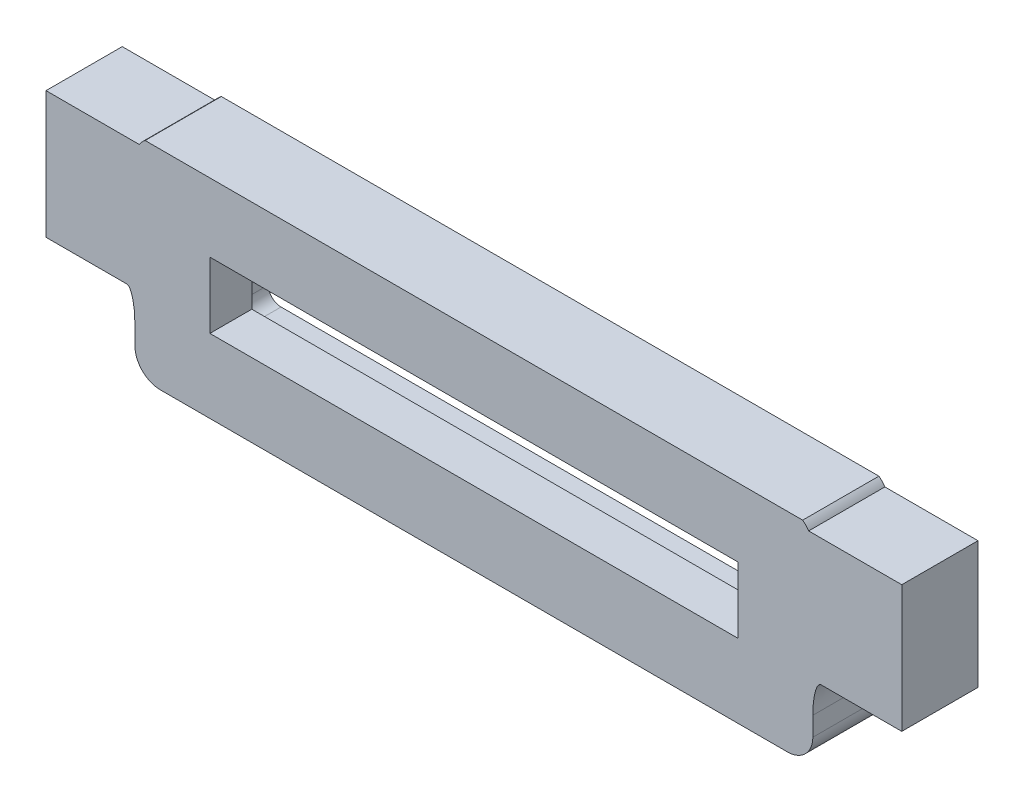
ISO-10303-21;
HEADER;
FILE_DESCRIPTION(('STEP AP214'),'2;1');
FILE_NAME('part.step','',(''),(''),'','','');
FILE_SCHEMA(('AUTOMOTIVE_DESIGN { 1 0 10303 214 1 1 1 1 }'));
ENDSEC;
DATA;
#1=APPLICATION_CONTEXT('core data for automotive mechanical design processes');
#2=APPLICATION_PROTOCOL_DEFINITION('international standard','automotive_design',2000,#1);
#3=PRODUCT_CONTEXT('',#1,'mechanical');
#4=PRODUCT('Part','Part','',(#3));
#5=PRODUCT_RELATED_PRODUCT_CATEGORY('part','',(#4));
#6=PRODUCT_DEFINITION_FORMATION('','',#4);
#7=PRODUCT_DEFINITION_CONTEXT('part definition',#1,'design');
#8=PRODUCT_DEFINITION('design','',#6,#7);
#9=PRODUCT_DEFINITION_SHAPE('','',#8);
#10=(LENGTH_UNIT() NAMED_UNIT(*) SI_UNIT(.MILLI.,.METRE.));
#11=(NAMED_UNIT(*) PLANE_ANGLE_UNIT() SI_UNIT($,.RADIAN.));
#12=(NAMED_UNIT(*) SI_UNIT($,.STERADIAN.) SOLID_ANGLE_UNIT());
#13=UNCERTAINTY_MEASURE_WITH_UNIT(LENGTH_MEASURE(1.E-05),#10,'distance_accuracy_value','');
#14=(GEOMETRIC_REPRESENTATION_CONTEXT(3) GLOBAL_UNCERTAINTY_ASSIGNED_CONTEXT((#13)) GLOBAL_UNIT_ASSIGNED_CONTEXT((#10,
#11,#12)) REPRESENTATION_CONTEXT('',''));
#15=CARTESIAN_POINT('',(0.,0.,0.));
#16=DIRECTION('',(0.,0.,1.));
#17=DIRECTION('',(1.,0.,0.));
#18=AXIS2_PLACEMENT_3D('',#15,#16,#17);
#19=CARTESIAN_POINT('',(20.78,2.6,27.));
#20=DIRECTION('',(0.,-1.,0.));
#21=DIRECTION('',(0.,0.,-1.));
#22=AXIS2_PLACEMENT_3D('',#19,#20,#21);
#23=PLANE('',#22);
#24=DIRECTION('',(1.,0.,0.));
#25=VECTOR('',#24,1.);
#26=CARTESIAN_POINT('',(20.78,2.6,22.05));
#27=LINE('',#26,#25);
#28=CARTESIAN_POINT('',(-20.78,2.6,22.05));
#29=VERTEX_POINT('',#28);
#30=CARTESIAN_POINT('',(20.78,2.6,22.05));
#31=VERTEX_POINT('',#30);
#32=EDGE_CURVE('E397',#29,#31,#27,.T.);
#33=ORIENTED_EDGE('',*,*,#32,.T.);
#34=DIRECTION('',(0.,0.,-1.));
#35=VECTOR('',#34,1.);
#36=CARTESIAN_POINT('',(20.78,2.6,27.));
#37=LINE('',#36,#35);
#38=CARTESIAN_POINT('',(20.78,2.6,25.35));
#39=VERTEX_POINT('',#38);
#40=EDGE_CURVE('E460',#39,#31,#37,.T.);
#41=ORIENTED_EDGE('',*,*,#40,.F.);
#42=DIRECTION('',(1.,0.,0.));
#43=VECTOR('',#42,1.);
#44=CARTESIAN_POINT('',(20.78,2.6,25.35));
#45=LINE('',#44,#43);
#46=CARTESIAN_POINT('',(-20.78,2.6,25.35));
#47=VERTEX_POINT('',#46);
#48=EDGE_CURVE('E286',#47,#39,#45,.T.);
#49=ORIENTED_EDGE('',*,*,#48,.F.);
#50=DIRECTION('',(0.,0.,-1.));
#51=VECTOR('',#50,1.);
#52=CARTESIAN_POINT('',(-20.78,2.6,27.));
#53=LINE('',#52,#51);
#54=EDGE_CURVE('E417',#47,#29,#53,.T.);
#55=ORIENTED_EDGE('',*,*,#54,.T.);
#56=EDGE_LOOP('',(#33,#41,#49,#55));
#57=FACE_BOUND('',#56,.T.);
#58=ADVANCED_FACE('F49',(#57),#23,.T.);
#59=CARTESIAN_POINT('',(-20.78,2.6,27.));
#60=DIRECTION('',(1.,0.,0.));
#61=DIRECTION('',(0.,0.,-1.));
#62=AXIS2_PLACEMENT_3D('',#59,#60,#61);
#63=PLANE('',#62);
#64=DIRECTION('',(0.,1.,0.));
#65=VECTOR('',#64,1.);
#66=CARTESIAN_POINT('',(-20.78,2.6,22.05));
#67=LINE('',#66,#65);
#68=CARTESIAN_POINT('',(-20.78,-2.6,22.05));
#69=VERTEX_POINT('',#68);
#70=EDGE_CURVE('E378',#69,#29,#67,.T.);
#71=ORIENTED_EDGE('',*,*,#70,.T.);
#72=ORIENTED_EDGE('',*,*,#54,.F.);
#73=DIRECTION('',(0.,1.,0.));
#74=VECTOR('',#73,1.);
#75=CARTESIAN_POINT('',(-20.78,2.6,25.35));
#76=LINE('',#75,#74);
#77=CARTESIAN_POINT('',(-20.78,-2.6,25.35));
#78=VERTEX_POINT('',#77);
#79=EDGE_CURVE('E284',#78,#47,#76,.T.);
#80=ORIENTED_EDGE('',*,*,#79,.F.);
#81=DIRECTION('',(0.,0.,-1.));
#82=VECTOR('',#81,1.);
#83=CARTESIAN_POINT('',(-20.78,-2.6,27.));
#84=LINE('',#83,#82);
#85=EDGE_CURVE('E466',#78,#69,#84,.T.);
#86=ORIENTED_EDGE('',*,*,#85,.T.);
#87=EDGE_LOOP('',(#71,#72,#80,#86));
#88=FACE_BOUND('',#87,.T.);
#89=ADVANCED_FACE('F475',(#88),#63,.T.);
#90=CARTESIAN_POINT('',(-20.78,-2.6,27.));
#91=DIRECTION('',(0.,1.,0.));
#92=DIRECTION('',(0.,0.,1.));
#93=AXIS2_PLACEMENT_3D('',#90,#91,#92);
#94=PLANE('',#93);
#95=DIRECTION('',(-1.,0.,0.));
#96=VECTOR('',#95,1.);
#97=CARTESIAN_POINT('',(-20.78,-2.6,22.05));
#98=LINE('',#97,#96);
#99=CARTESIAN_POINT('',(20.78,-2.6,22.05));
#100=VERTEX_POINT('',#99);
#101=EDGE_CURVE('E391',#100,#69,#98,.T.);
#102=ORIENTED_EDGE('',*,*,#101,.T.);
#103=ORIENTED_EDGE('',*,*,#85,.F.);
#104=DIRECTION('',(-1.,0.,0.));
#105=VECTOR('',#104,1.);
#106=CARTESIAN_POINT('',(-20.78,-2.6,25.35));
#107=LINE('',#106,#105);
#108=CARTESIAN_POINT('',(20.78,-2.6,25.35));
#109=VERTEX_POINT('',#108);
#110=EDGE_CURVE('E282',#109,#78,#107,.T.);
#111=ORIENTED_EDGE('',*,*,#110,.F.);
#112=DIRECTION('',(0.,0.,-1.));
#113=VECTOR('',#112,1.);
#114=CARTESIAN_POINT('',(20.78,-2.6,27.));
#115=LINE('',#114,#113);
#116=EDGE_CURVE('E463',#109,#100,#115,.T.);
#117=ORIENTED_EDGE('',*,*,#116,.T.);
#118=EDGE_LOOP('',(#102,#103,#111,#117));
#119=FACE_BOUND('',#118,.T.);
#120=ADVANCED_FACE('F481',(#119),#94,.T.);
#121=CARTESIAN_POINT('',(20.78,-2.6,27.));
#122=DIRECTION('',(-1.,0.,0.));
#123=DIRECTION('',(0.,0.,1.));
#124=AXIS2_PLACEMENT_3D('',#121,#122,#123);
#125=PLANE('',#124);
#126=DIRECTION('',(0.,-1.,0.));
#127=VECTOR('',#126,1.);
#128=CARTESIAN_POINT('',(20.78,-2.6,22.05));
#129=LINE('',#128,#127);
#130=EDGE_CURVE('E394',#31,#100,#129,.T.);
#131=ORIENTED_EDGE('',*,*,#130,.T.);
#132=ORIENTED_EDGE('',*,*,#116,.F.);
#133=DIRECTION('',(0.,-1.,0.));
#134=VECTOR('',#133,1.);
#135=CARTESIAN_POINT('',(20.78,-2.6,25.35));
#136=LINE('',#135,#134);
#137=EDGE_CURVE('E280',#39,#109,#136,.T.);
#138=ORIENTED_EDGE('',*,*,#137,.F.);
#139=ORIENTED_EDGE('',*,*,#40,.T.);
#140=EDGE_LOOP('',(#131,#132,#138,#139));
#141=FACE_BOUND('',#140,.T.);
#142=ADVANCED_FACE('F486',(#141),#125,.T.);
#143=CARTESIAN_POINT('',(-26.68,8.4,27.));
#144=DIRECTION('',(1.,0.,0.));
#145=DIRECTION('',(0.,0.,-1.));
#146=AXIS2_PLACEMENT_3D('',#143,#144,#145);
#147=PLANE('',#146);
#148=DIRECTION('',(0.,-1.,0.));
#149=VECTOR('',#148,1.);
#150=CARTESIAN_POINT('',(-26.68,-8.4,25.35));
#151=LINE('',#150,#149);
#152=CARTESIAN_POINT('',(-26.68,-4.89999999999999,25.35));
#153=VERTEX_POINT('',#152);
#154=CARTESIAN_POINT('',(-26.68,-6.4,25.35));
#155=VERTEX_POINT('',#154);
#156=EDGE_CURVE('E262',#153,#155,#151,.T.);
#157=ORIENTED_EDGE('',*,*,#156,.F.);
#158=CARTESIAN_POINT('',(-26.68,-4.89999999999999,19.05));
#159=CARTESIAN_POINT('',(-26.68,-4.89999999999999,21.25));
#160=CARTESIAN_POINT('',(-26.68,-4.89999999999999,23.45));
#161=CARTESIAN_POINT('',(-26.68,-4.89999999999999,25.65));
#162=(BOUNDED_CURVE() B_SPLINE_CURVE(3,(#158,#159,#160,#161),.UNSPECIFIED.,.F.,
.F.) B_SPLINE_CURVE_WITH_KNOTS((4,4),(0.00135,0.00795),
.UNSPECIFIED.) CURVE() GEOMETRIC_REPRESENTATION_ITEM() RATIONAL_B_SPLINE_CURVE((1.,1.,1.,1.)) REPRESENTATION_ITEM(''));
#163=CARTESIAN_POINT('',(-26.68,-4.89999999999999,19.35));
#164=VERTEX_POINT('',#163);
#165=EDGE_CURVE('E254',#153,#164,#162,.F.);
#166=ORIENTED_EDGE('',*,*,#165,.T.);
#167=DIRECTION('',(0.,-1.,0.));
#168=VECTOR('',#167,1.);
#169=CARTESIAN_POINT('',(-26.68,8.4,19.35));
#170=LINE('',#169,#168);
#171=CARTESIAN_POINT('',(-26.68,-6.4,19.35));
#172=VERTEX_POINT('',#171);
#173=EDGE_CURVE('E267',#164,#172,#170,.T.);
#174=ORIENTED_EDGE('',*,*,#173,.T.);
#175=DIRECTION('',(0.,0.,-1.));
#176=VECTOR('',#175,1.);
#177=CARTESIAN_POINT('',(-26.68,-6.4,27.));
#178=LINE('',#177,#176);
#179=EDGE_CURVE('E430',#172,#155,#178,.F.);
#180=ORIENTED_EDGE('',*,*,#179,.T.);
#181=EDGE_LOOP('',(#157,#166,#174,#180));
#182=FACE_BOUND('',#181,.T.);
#183=ADVANCED_FACE('F509',(#182),#147,.F.);
#184=CARTESIAN_POINT('',(26.68,8.4,27.));
#185=DIRECTION('',(-1.,0.,0.));
#186=DIRECTION('',(0.,0.,1.));
#187=AXIS2_PLACEMENT_3D('',#184,#185,#186);
#188=PLANE('',#187);
#189=DIRECTION('',(0.,1.,0.));
#190=VECTOR('',#189,1.);
#191=CARTESIAN_POINT('',(26.68,-8.4,19.35));
#192=LINE('',#191,#190);
#193=CARTESIAN_POINT('',(26.68,-6.4,19.35));
#194=VERTEX_POINT('',#193);
#195=CARTESIAN_POINT('',(26.68,-4.9,19.35));
#196=VERTEX_POINT('',#195);
#197=EDGE_CURVE('E361',#194,#196,#192,.T.);
#198=ORIENTED_EDGE('',*,*,#197,.T.);
#199=CARTESIAN_POINT('',(26.68,-4.9,25.65));
#200=CARTESIAN_POINT('',(26.68,-4.9,23.45));
#201=CARTESIAN_POINT('',(26.68,-4.9,21.25));
#202=CARTESIAN_POINT('',(26.68,-4.9,19.05));
#203=(BOUNDED_CURVE() B_SPLINE_CURVE(3,(#199,#200,#201,#202),.UNSPECIFIED.,.F.,
.F.) B_SPLINE_CURVE_WITH_KNOTS((4,4),(-0.0063,0.0003),
.UNSPECIFIED.) CURVE() GEOMETRIC_REPRESENTATION_ITEM() RATIONAL_B_SPLINE_CURVE((1.,1.,1.,1.)) REPRESENTATION_ITEM(''));
#204=CARTESIAN_POINT('',(26.68,-4.9,25.35));
#205=VERTEX_POINT('',#204);
#206=EDGE_CURVE('E692',#196,#205,#203,.F.);
#207=ORIENTED_EDGE('',*,*,#206,.T.);
#208=DIRECTION('',(0.,1.,0.));
#209=VECTOR('',#208,1.);
#210=CARTESIAN_POINT('',(26.68,-8.4,25.35));
#211=LINE('',#210,#209);
#212=CARTESIAN_POINT('',(26.68,-6.4,25.35));
#213=VERTEX_POINT('',#212);
#214=EDGE_CURVE('E276',#213,#205,#211,.T.);
#215=ORIENTED_EDGE('',*,*,#214,.F.);
#216=DIRECTION('',(0.,0.,-1.));
#217=VECTOR('',#216,1.);
#218=CARTESIAN_POINT('',(26.68,-6.4,27.));
#219=LINE('',#218,#217);
#220=EDGE_CURVE('E413',#213,#194,#219,.T.);
#221=ORIENTED_EDGE('',*,*,#220,.T.);
#222=EDGE_LOOP('',(#198,#207,#215,#221));
#223=FACE_BOUND('',#222,.T.);
#224=ADVANCED_FACE('F504',(#223),#188,.F.);
#225=CARTESIAN_POINT('',(26.68,-8.4,27.));
#226=DIRECTION('',(0.,1.,0.));
#227=DIRECTION('',(0.,0.,1.));
#228=AXIS2_PLACEMENT_3D('',#225,#226,#227);
#229=PLANE('',#228);
#230=DIRECTION('',(0.,0.,-1.));
#231=VECTOR('',#230,1.);
#232=CARTESIAN_POINT('',(24.68,-8.4,27.));
#233=LINE('',#232,#231);
#234=CARTESIAN_POINT('',(24.68,-8.4,19.35));
#235=VERTEX_POINT('',#234);
#236=CARTESIAN_POINT('',(24.68,-8.4,25.35));
#237=VERTEX_POINT('',#236);
#238=EDGE_CURVE('E427',#235,#237,#233,.F.);
#239=ORIENTED_EDGE('',*,*,#238,.T.);
#240=DIRECTION('',(1.,0.,0.));
#241=VECTOR('',#240,1.);
#242=CARTESIAN_POINT('',(-26.68,-8.4,25.35));
#243=LINE('',#242,#241);
#244=CARTESIAN_POINT('',(-24.68,-8.4,25.35));
#245=VERTEX_POINT('',#244);
#246=EDGE_CURVE('E265',#245,#237,#243,.T.);
#247=ORIENTED_EDGE('',*,*,#246,.F.);
#248=DIRECTION('',(0.,0.,-1.));
#249=VECTOR('',#248,1.);
#250=CARTESIAN_POINT('',(-24.68,-8.4,27.));
#251=LINE('',#250,#249);
#252=CARTESIAN_POINT('',(-24.68,-8.4,19.35));
#253=VERTEX_POINT('',#252);
#254=EDGE_CURVE('E425',#245,#253,#251,.T.);
#255=ORIENTED_EDGE('',*,*,#254,.T.);
#256=DIRECTION('',(1.,0.,0.));
#257=VECTOR('',#256,1.);
#258=CARTESIAN_POINT('',(-26.68,-8.4,19.35));
#259=LINE('',#258,#257);
#260=EDGE_CURVE('E456',#253,#235,#259,.T.);
#261=ORIENTED_EDGE('',*,*,#260,.T.);
#262=EDGE_LOOP('',(#239,#247,#255,#261));
#263=FACE_BOUND('',#262,.T.);
#264=ADVANCED_FACE('F508',(#263),#229,.F.);
#265=CARTESIAN_POINT('',(0.,0.,19.35));
#266=DIRECTION('',(0.,0.,1.));
#267=DIRECTION('',(1.,0.,0.));
#268=AXIS2_PLACEMENT_3D('',#265,#266,#267);
#269=PLANE('',#268);
#270=DIRECTION('',(0.,-1.,0.));
#271=VECTOR('',#270,1.);
#272=CARTESIAN_POINT('',(22.18,-4.,19.35));
#273=LINE('',#272,#271);
#274=CARTESIAN_POINT('',(22.18,3.,19.35));
#275=VERTEX_POINT('',#274);
#276=CARTESIAN_POINT('',(22.18,-3.,19.35));
#277=VERTEX_POINT('',#276);
#278=EDGE_CURVE('E372',#275,#277,#273,.T.);
#279=ORIENTED_EDGE('',*,*,#278,.F.);
#280=CARTESIAN_POINT('',(21.18,3.,19.35));
#281=DIRECTION('',(0.,0.,1.));
#282=DIRECTION('',(1.,0.,0.));
#283=AXIS2_PLACEMENT_3D('',#280,#281,#282);
#284=CIRCLE('',#283,1.);
#285=CARTESIAN_POINT('',(21.18,4.,19.35));
#286=VERTEX_POINT('',#285);
#287=EDGE_CURVE('E1037',#275,#286,#284,.T.);
#288=ORIENTED_EDGE('',*,*,#287,.T.);
#289=DIRECTION('',(1.,0.,0.));
#290=VECTOR('',#289,1.);
#291=CARTESIAN_POINT('',(22.18,4.,19.35));
#292=LINE('',#291,#290);
#293=CARTESIAN_POINT('',(-21.18,4.,19.35));
#294=VERTEX_POINT('',#293);
#295=EDGE_CURVE('E375',#294,#286,#292,.T.);
#296=ORIENTED_EDGE('',*,*,#295,.F.);
#297=CARTESIAN_POINT('',(-21.18,3.,19.35));
#298=DIRECTION('',(0.,0.,1.));
#299=DIRECTION('',(1.,0.,0.));
#300=AXIS2_PLACEMENT_3D('',#297,#298,#299);
#301=CIRCLE('',#300,1.);
#302=CARTESIAN_POINT('',(-22.18,3.,19.35));
#303=VERTEX_POINT('',#302);
#304=EDGE_CURVE('E13',#294,#303,#301,.T.);
#305=ORIENTED_EDGE('',*,*,#304,.T.);
#306=DIRECTION('',(0.,1.,0.));
#307=VECTOR('',#306,1.);
#308=CARTESIAN_POINT('',(-22.18,4.,19.35));
#309=LINE('',#308,#307);
#310=CARTESIAN_POINT('',(-22.18,-3.,19.35));
#311=VERTEX_POINT('',#310);
#312=EDGE_CURVE('E366',#311,#303,#309,.T.);
#313=ORIENTED_EDGE('',*,*,#312,.F.);
#314=CARTESIAN_POINT('',(-21.18,-3.,19.35));
#315=DIRECTION('',(0.,0.,1.));
#316=DIRECTION('',(1.,0.,0.));
#317=AXIS2_PLACEMENT_3D('',#314,#315,#316);
#318=CIRCLE('',#317,1.);
#319=CARTESIAN_POINT('',(-21.18,-4.,19.35));
#320=VERTEX_POINT('',#319);
#321=EDGE_CURVE('E57',#311,#320,#318,.T.);
#322=ORIENTED_EDGE('',*,*,#321,.T.);
#323=DIRECTION('',(-1.,0.,0.));
#324=VECTOR('',#323,1.);
#325=CARTESIAN_POINT('',(-22.18,-4.,19.35));
#326=LINE('',#325,#324);
#327=CARTESIAN_POINT('',(21.18,-4.,19.35));
#328=VERTEX_POINT('',#327);
#329=EDGE_CURVE('E369',#328,#320,#326,.T.);
#330=ORIENTED_EDGE('',*,*,#329,.F.);
#331=CARTESIAN_POINT('',(21.18,-3.,19.35));
#332=DIRECTION('',(0.,0.,1.));
#333=DIRECTION('',(1.,0.,0.));
#334=AXIS2_PLACEMENT_3D('',#331,#332,#333);
#335=CIRCLE('',#334,1.);
#336=EDGE_CURVE('E1035',#328,#277,#335,.T.);
#337=ORIENTED_EDGE('',*,*,#336,.T.);
#338=EDGE_LOOP('',(#279,#288,#296,#305,#313,#322,#330,#337));
#339=FACE_BOUND('',#338,.T.);
#340=CARTESIAN_POINT('',(-24.68,6.4,19.35));
#341=DIRECTION('',(0.,0.,1.));
#342=DIRECTION('',(1.,0.,0.));
#343=AXIS2_PLACEMENT_3D('',#340,#341,#342);
#344=CIRCLE('',#343,2.);
#345=CARTESIAN_POINT('',(-26.350329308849,7.50000000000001,19.35));
#346=VERTEX_POINT('',#345);
#347=CARTESIAN_POINT('',(-25.88,8.,19.35));
#348=VERTEX_POINT('',#347);
#349=EDGE_CURVE('E410',#346,#348,#344,.F.);
#350=ORIENTED_EDGE('',*,*,#349,.T.);
#351=DIRECTION('',(-1.,0.,0.));
#352=VECTOR('',#351,1.);
#353=CARTESIAN_POINT('',(-25.88,8.,19.35));
#354=LINE('',#353,#352);
#355=CARTESIAN_POINT('',(25.88,8.,19.35));
#356=VERTEX_POINT('',#355);
#357=EDGE_CURVE('E64',#356,#348,#354,.T.);
#358=ORIENTED_EDGE('',*,*,#357,.F.);
#359=CARTESIAN_POINT('',(24.68,6.4,19.35));
#360=DIRECTION('',(0.,0.,1.));
#361=DIRECTION('',(1.,0.,0.));
#362=AXIS2_PLACEMENT_3D('',#359,#360,#361);
#363=CIRCLE('',#362,2.);
#364=CARTESIAN_POINT('',(26.350329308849,7.5,19.35));
#365=VERTEX_POINT('',#364);
#366=EDGE_CURVE('E405',#356,#365,#363,.F.);
#367=ORIENTED_EDGE('',*,*,#366,.T.);
#368=DIRECTION('',(1.,0.,0.));
#369=VECTOR('',#368,1.);
#370=CARTESIAN_POINT('',(0.,7.5,19.35));
#371=LINE('',#370,#369);
#372=CARTESIAN_POINT('',(33.68,7.5,19.35));
#373=VERTEX_POINT('',#372);
#374=EDGE_CURVE('E435',#365,#373,#371,.T.);
#375=ORIENTED_EDGE('',*,*,#374,.T.);
#376=DIRECTION('',(0.,1.,0.));
#377=VECTOR('',#376,1.);
#378=CARTESIAN_POINT('',(33.68,0.,19.35));
#379=LINE('',#378,#377);
#380=CARTESIAN_POINT('',(33.68,-2.5,19.35));
#381=VERTEX_POINT('',#380);
#382=EDGE_CURVE('E445',#381,#373,#379,.T.);
#383=ORIENTED_EDGE('',*,*,#382,.F.);
#384=DIRECTION('',(1.,0.,0.));
#385=VECTOR('',#384,1.);
#386=CARTESIAN_POINT('',(0.,-2.5,19.35));
#387=LINE('',#386,#385);
#388=CARTESIAN_POINT('',(27.33,-2.5,19.35));
#389=VERTEX_POINT('',#388);
#390=EDGE_CURVE('E441',#389,#381,#387,.T.);
#391=ORIENTED_EDGE('',*,*,#390,.F.);
#392=CARTESIAN_POINT('',(26.68,-4.9,19.35));
#393=CARTESIAN_POINT('',(26.68,-2.5,19.35));
#394=CARTESIAN_POINT('',(27.33,-2.5,19.35));
#395=(BOUNDED_CURVE() B_SPLINE_CURVE(2,(#392,#393,#394),.UNSPECIFIED.,.F.,
.F.) B_SPLINE_CURVE_WITH_KNOTS((3,3),(0.,1.),
.UNSPECIFIED.) CURVE() GEOMETRIC_REPRESENTATION_ITEM() RATIONAL_B_SPLINE_CURVE((1.,
0.707106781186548,1.)) REPRESENTATION_ITEM(''));
#396=EDGE_CURVE('E524',#389,#196,#395,.F.);
#397=ORIENTED_EDGE('',*,*,#396,.T.);
#398=ORIENTED_EDGE('',*,*,#197,.F.);
#399=CARTESIAN_POINT('',(24.68,-6.4,19.35));
#400=DIRECTION('',(0.,0.,1.));
#401=DIRECTION('',(1.,0.,0.));
#402=AXIS2_PLACEMENT_3D('',#399,#400,#401);
#403=CIRCLE('',#402,2.);
#404=EDGE_CURVE('E423',#194,#235,#403,.F.);
#405=ORIENTED_EDGE('',*,*,#404,.T.);
#406=ORIENTED_EDGE('',*,*,#260,.F.);
#407=CARTESIAN_POINT('',(-24.68,-6.4,19.35));
#408=DIRECTION('',(0.,0.,1.));
#409=DIRECTION('',(1.,0.,0.));
#410=AXIS2_PLACEMENT_3D('',#407,#408,#409);
#411=CIRCLE('',#410,2.);
#412=EDGE_CURVE('E415',#253,#172,#411,.F.);
#413=ORIENTED_EDGE('',*,*,#412,.T.);
#414=ORIENTED_EDGE('',*,*,#173,.F.);
#415=CARTESIAN_POINT('',(-27.33,-2.49999999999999,19.35));
#416=CARTESIAN_POINT('',(-26.68,-2.49999999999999,19.35));
#417=CARTESIAN_POINT('',(-26.68,-4.89999999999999,19.35));
#418=(BOUNDED_CURVE() B_SPLINE_CURVE(2,(#415,#416,#417),.UNSPECIFIED.,.F.,
.F.) B_SPLINE_CURVE_WITH_KNOTS((3,3),(0.,1.),
.UNSPECIFIED.) CURVE() GEOMETRIC_REPRESENTATION_ITEM() RATIONAL_B_SPLINE_CURVE((1.,
0.707106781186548,1.)) REPRESENTATION_ITEM(''));
#419=CARTESIAN_POINT('',(-27.33,-2.49999999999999,19.35));
#420=VERTEX_POINT('',#419);
#421=EDGE_CURVE('E562',#164,#420,#418,.F.);
#422=ORIENTED_EDGE('',*,*,#421,.T.);
#423=DIRECTION('',(-1.,0.,0.));
#424=VECTOR('',#423,1.);
#425=CARTESIAN_POINT('',(0.,-2.5,19.35));
#426=LINE('',#425,#424);
#427=CARTESIAN_POINT('',(-33.68,-2.49999999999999,19.35));
#428=VERTEX_POINT('',#427);
#429=EDGE_CURVE('E292',#420,#428,#426,.T.);
#430=ORIENTED_EDGE('',*,*,#429,.T.);
#431=DIRECTION('',(0.,1.,0.));
#432=VECTOR('',#431,1.);
#433=CARTESIAN_POINT('',(-33.68,0.,19.35));
#434=LINE('',#433,#432);
#435=CARTESIAN_POINT('',(-33.68,7.50000000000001,19.35));
#436=VERTEX_POINT('',#435);
#437=EDGE_CURVE('E687',#428,#436,#434,.T.);
#438=ORIENTED_EDGE('',*,*,#437,.T.);
#439=DIRECTION('',(-1.,0.,0.));
#440=VECTOR('',#439,1.);
#441=CARTESIAN_POINT('',(0.,7.5,19.35));
#442=LINE('',#441,#440);
#443=EDGE_CURVE('E309',#346,#436,#442,.T.);
#444=ORIENTED_EDGE('',*,*,#443,.F.);
#445=EDGE_LOOP('',(#350,#358,#367,#375,#383,#391,#397,#398,#405,#406,#413,#414,#422,#430,#438,#444));
#446=FACE_BOUND('',#445,.T.);
#447=ADVANCED_FACE('F407',(#339,#446),#269,.F.);
#448=CARTESIAN_POINT('',(33.68,0.,25.35));
#449=DIRECTION('',(-1.,0.,0.));
#450=DIRECTION('',(0.,0.,1.));
#451=AXIS2_PLACEMENT_3D('',#448,#449,#450);
#452=PLANE('',#451);
#453=ORIENTED_EDGE('',*,*,#382,.T.);
#454=DIRECTION('',(0.,0.,-1.));
#455=VECTOR('',#454,1.);
#456=CARTESIAN_POINT('',(33.68,7.5,25.35));
#457=LINE('',#456,#455);
#458=CARTESIAN_POINT('',(33.68,7.5,25.35));
#459=VERTEX_POINT('',#458);
#460=EDGE_CURVE('E437',#459,#373,#457,.T.);
#461=ORIENTED_EDGE('',*,*,#460,.F.);
#462=DIRECTION('',(0.,1.,0.));
#463=VECTOR('',#462,1.);
#464=CARTESIAN_POINT('',(33.68,0.,25.35));
#465=LINE('',#464,#463);
#466=CARTESIAN_POINT('',(33.68,-2.5,25.35));
#467=VERTEX_POINT('',#466);
#468=EDGE_CURVE('E440',#467,#459,#465,.T.);
#469=ORIENTED_EDGE('',*,*,#468,.F.);
#470=DIRECTION('',(0.,0.,-1.));
#471=VECTOR('',#470,1.);
#472=CARTESIAN_POINT('',(33.68,-2.5,25.35));
#473=LINE('',#472,#471);
#474=EDGE_CURVE('E452',#467,#381,#473,.T.);
#475=ORIENTED_EDGE('',*,*,#474,.T.);
#476=EDGE_LOOP('',(#453,#461,#469,#475));
#477=FACE_BOUND('',#476,.T.);
#478=ADVANCED_FACE('F340',(#477),#452,.F.);
#479=CARTESIAN_POINT('',(0.,7.5,25.35));
#480=DIRECTION('',(0.,1.,0.));
#481=DIRECTION('',(0.,0.,1.));
#482=AXIS2_PLACEMENT_3D('',#479,#480,#481);
#483=PLANE('',#482);
#484=ORIENTED_EDGE('',*,*,#374,.F.);
#485=DIRECTION('',(0.,0.,-1.));
#486=VECTOR('',#485,1.);
#487=CARTESIAN_POINT('',(26.350329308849,7.5,19.35));
#488=LINE('',#487,#486);
#489=CARTESIAN_POINT('',(26.350329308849,7.5,25.35));
#490=VERTEX_POINT('',#489);
#491=EDGE_CURVE('E258',#365,#490,#488,.F.);
#492=ORIENTED_EDGE('',*,*,#491,.T.);
#493=DIRECTION('',(1.,0.,0.));
#494=VECTOR('',#493,1.);
#495=CARTESIAN_POINT('',(0.,7.5,25.35));
#496=LINE('',#495,#494);
#497=EDGE_CURVE('E433',#490,#459,#496,.T.);
#498=ORIENTED_EDGE('',*,*,#497,.T.);
#499=ORIENTED_EDGE('',*,*,#460,.T.);
#500=EDGE_LOOP('',(#484,#492,#498,#499));
#501=FACE_BOUND('',#500,.T.);
#502=ADVANCED_FACE('F336',(#501),#483,.T.);
#503=CARTESIAN_POINT('',(0.,-2.5,25.35));
#504=DIRECTION('',(0.,1.,0.));
#505=DIRECTION('',(-1.,0.,0.));
#506=AXIS2_PLACEMENT_3D('',#503,#504,#505);
#507=PLANE('',#506);
#508=CARTESIAN_POINT('',(30.7,-2.5,22.35));
#509=DIRECTION('',(0.,-1.,0.));
#510=DIRECTION('',(1.,0.,0.));
#511=AXIS2_PLACEMENT_3D('',#508,#509,#510);
#512=CIRCLE('',#511,1.35000000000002);
#513=CARTESIAN_POINT('',(32.05,-2.5,22.35));
#514=VERTEX_POINT('',#513);
#515=EDGE_CURVE('E296',#514,#514,#512,.F.);
#516=ORIENTED_EDGE('',*,*,#515,.T.);
#517=EDGE_LOOP('',(#516));
#518=FACE_BOUND('',#517,.T.);
#519=DIRECTION('',(1.,0.,0.));
#520=VECTOR('',#519,1.);
#521=CARTESIAN_POINT('',(0.,-2.5,25.35));
#522=LINE('',#521,#520);
#523=CARTESIAN_POINT('',(27.33,-2.5,25.35));
#524=VERTEX_POINT('',#523);
#525=EDGE_CURVE('E443',#524,#467,#522,.T.);
#526=ORIENTED_EDGE('',*,*,#525,.F.);
#527=CARTESIAN_POINT('',(27.33,-2.5,19.05));
#528=CARTESIAN_POINT('',(27.33,-2.5,21.25));
#529=CARTESIAN_POINT('',(27.33,-2.5,23.45));
#530=CARTESIAN_POINT('',(27.33,-2.5,25.65));
#531=(BOUNDED_CURVE() B_SPLINE_CURVE(3,(#527,#528,#529,#530),.UNSPECIFIED.,.F.,
.F.) B_SPLINE_CURVE_WITH_KNOTS((4,4),(-0.0063,0.0003),
.UNSPECIFIED.) CURVE() GEOMETRIC_REPRESENTATION_ITEM() RATIONAL_B_SPLINE_CURVE((1.,1.,1.,1.)) REPRESENTATION_ITEM(''));
#532=EDGE_CURVE('E691',#524,#389,#531,.F.);
#533=ORIENTED_EDGE('',*,*,#532,.T.);
#534=ORIENTED_EDGE('',*,*,#390,.T.);
#535=ORIENTED_EDGE('',*,*,#474,.F.);
#536=EDGE_LOOP('',(#526,#533,#534,#535));
#537=FACE_BOUND('',#536,.T.);
#538=ADVANCED_FACE('F339',(#518,#537),#507,.F.);
#539=CARTESIAN_POINT('',(0.,0.,25.35));
#540=DIRECTION('',(0.,0.,-1.));
#541=DIRECTION('',(-1.,0.,0.));
#542=AXIS2_PLACEMENT_3D('',#539,#540,#541);
#543=PLANE('',#542);
#544=CARTESIAN_POINT('',(24.68,6.4,25.35));
#545=DIRECTION('',(0.,0.,-1.));
#546=DIRECTION('',(-1.,0.,0.));
#547=AXIS2_PLACEMENT_3D('',#544,#545,#546);
#548=CIRCLE('',#547,2.);
#549=CARTESIAN_POINT('',(25.88,8.,25.35));
#550=VERTEX_POINT('',#549);
#551=EDGE_CURVE('E248',#490,#550,#548,.F.);
#552=ORIENTED_EDGE('',*,*,#551,.T.);
#553=DIRECTION('',(1.,0.,0.));
#554=VECTOR('',#553,1.);
#555=CARTESIAN_POINT('',(-25.88,8.,25.35));
#556=LINE('',#555,#554);
#557=CARTESIAN_POINT('',(-25.88,8.,25.35));
#558=VERTEX_POINT('',#557);
#559=EDGE_CURVE('E233',#558,#550,#556,.T.);
#560=ORIENTED_EDGE('',*,*,#559,.F.);
#561=CARTESIAN_POINT('',(-24.68,6.4,25.35));
#562=DIRECTION('',(0.,0.,-1.));
#563=DIRECTION('',(-1.,0.,0.));
#564=AXIS2_PLACEMENT_3D('',#561,#562,#563);
#565=CIRCLE('',#564,2.);
#566=CARTESIAN_POINT('',(-26.350329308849,7.50000000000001,25.35));
#567=VERTEX_POINT('',#566);
#568=EDGE_CURVE('E245',#558,#567,#565,.F.);
#569=ORIENTED_EDGE('',*,*,#568,.T.);
#570=DIRECTION('',(-1.,0.,0.));
#571=VECTOR('',#570,1.);
#572=CARTESIAN_POINT('',(0.,7.5,25.35));
#573=LINE('',#572,#571);
#574=CARTESIAN_POINT('',(-33.68,7.50000000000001,25.35));
#575=VERTEX_POINT('',#574);
#576=EDGE_CURVE('E684',#567,#575,#573,.T.);
#577=ORIENTED_EDGE('',*,*,#576,.T.);
#578=DIRECTION('',(0.,1.,0.));
#579=VECTOR('',#578,1.);
#580=CARTESIAN_POINT('',(-33.68,0.,25.35));
#581=LINE('',#580,#579);
#582=CARTESIAN_POINT('',(-33.68,-2.49999999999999,25.35));
#583=VERTEX_POINT('',#582);
#584=EDGE_CURVE('E303',#583,#575,#581,.T.);
#585=ORIENTED_EDGE('',*,*,#584,.F.);
#586=DIRECTION('',(-1.,0.,0.));
#587=VECTOR('',#586,1.);
#588=CARTESIAN_POINT('',(0.,-2.5,25.35));
#589=LINE('',#588,#587);
#590=CARTESIAN_POINT('',(-27.33,-2.49999999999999,25.35));
#591=VERTEX_POINT('',#590);
#592=EDGE_CURVE('E306',#591,#583,#589,.T.);
#593=ORIENTED_EDGE('',*,*,#592,.F.);
#594=CARTESIAN_POINT('',(-26.68,-4.89999999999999,25.35));
#595=CARTESIAN_POINT('',(-26.68,-2.49999999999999,25.35));
#596=CARTESIAN_POINT('',(-27.33,-2.49999999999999,25.35));
#597=(BOUNDED_CURVE() B_SPLINE_CURVE(2,(#594,#595,#596),.UNSPECIFIED.,.F.,
.F.) B_SPLINE_CURVE_WITH_KNOTS((3,3),(0.,1.),
.UNSPECIFIED.) CURVE() GEOMETRIC_REPRESENTATION_ITEM() RATIONAL_B_SPLINE_CURVE((1.,
0.707106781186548,1.)) REPRESENTATION_ITEM(''));
#598=EDGE_CURVE('E549',#591,#153,#597,.F.);
#599=ORIENTED_EDGE('',*,*,#598,.T.);
#600=ORIENTED_EDGE('',*,*,#156,.T.);
#601=CARTESIAN_POINT('',(-24.68,-6.4,25.35));
#602=DIRECTION('',(0.,0.,-1.));
#603=DIRECTION('',(-1.,0.,0.));
#604=AXIS2_PLACEMENT_3D('',#601,#602,#603);
#605=CIRCLE('',#604,2.);
#606=EDGE_CURVE('E275',#155,#245,#605,.F.);
#607=ORIENTED_EDGE('',*,*,#606,.T.);
#608=ORIENTED_EDGE('',*,*,#246,.T.);
#609=CARTESIAN_POINT('',(24.68,-6.4,25.35));
#610=DIRECTION('',(0.,0.,-1.));
#611=DIRECTION('',(-1.,0.,0.));
#612=AXIS2_PLACEMENT_3D('',#609,#610,#611);
#613=CIRCLE('',#612,2.);
#614=EDGE_CURVE('E278',#237,#213,#613,.F.);
#615=ORIENTED_EDGE('',*,*,#614,.T.);
#616=ORIENTED_EDGE('',*,*,#214,.T.);
#617=CARTESIAN_POINT('',(27.33,-2.5,25.35));
#618=CARTESIAN_POINT('',(26.68,-2.5,25.35));
#619=CARTESIAN_POINT('',(26.68,-4.9,25.35));
#620=(BOUNDED_CURVE() B_SPLINE_CURVE(2,(#617,#618,#619),.UNSPECIFIED.,.F.,
.F.) B_SPLINE_CURVE_WITH_KNOTS((3,3),(0.,1.),
.UNSPECIFIED.) CURVE() GEOMETRIC_REPRESENTATION_ITEM() RATIONAL_B_SPLINE_CURVE((1.,
0.707106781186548,1.)) REPRESENTATION_ITEM(''));
#621=EDGE_CURVE('E999',#205,#524,#620,.F.);
#622=ORIENTED_EDGE('',*,*,#621,.T.);
#623=ORIENTED_EDGE('',*,*,#525,.T.);
#624=ORIENTED_EDGE('',*,*,#468,.T.);
#625=ORIENTED_EDGE('',*,*,#497,.F.);
#626=EDGE_LOOP('',(#552,#560,#569,#577,#585,#593,#599,#600,#607,#608,#615,#616,#622,#623,#624,#625));
#627=FACE_BOUND('',#626,.T.);
#628=ORIENTED_EDGE('',*,*,#48,.T.);
#629=ORIENTED_EDGE('',*,*,#137,.T.);
#630=ORIENTED_EDGE('',*,*,#110,.T.);
#631=ORIENTED_EDGE('',*,*,#79,.T.);
#632=EDGE_LOOP('',(#628,#629,#630,#631));
#633=FACE_BOUND('',#632,.T.);
#634=ADVANCED_FACE('F243',(#627,#633),#543,.F.);
#635=CARTESIAN_POINT('',(0.,7.5,25.35));
#636=DIRECTION('',(0.,-1.,0.));
#637=DIRECTION('',(1.,0.,0.));
#638=AXIS2_PLACEMENT_3D('',#635,#636,#637);
#639=PLANE('',#638);
#640=ORIENTED_EDGE('',*,*,#443,.T.);
#641=DIRECTION('',(0.,0.,-1.));
#642=VECTOR('',#641,1.);
#643=CARTESIAN_POINT('',(-33.68,7.50000000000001,25.35));
#644=LINE('',#643,#642);
#645=EDGE_CURVE('E675',#575,#436,#644,.T.);
#646=ORIENTED_EDGE('',*,*,#645,.F.);
#647=ORIENTED_EDGE('',*,*,#576,.F.);
#648=DIRECTION('',(0.,0.,-1.));
#649=VECTOR('',#648,1.);
#650=CARTESIAN_POINT('',(-26.350329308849,7.50000000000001,25.35));
#651=LINE('',#650,#649);
#652=EDGE_CURVE('E253',#567,#346,#651,.T.);
#653=ORIENTED_EDGE('',*,*,#652,.T.);
#654=EDGE_LOOP('',(#640,#646,#647,#653));
#655=FACE_BOUND('',#654,.T.);
#656=ADVANCED_FACE('F488',(#655),#639,.F.);
#657=CARTESIAN_POINT('',(-33.68,0.,25.35));
#658=DIRECTION('',(-1.,0.,0.));
#659=DIRECTION('',(0.,0.,1.));
#660=AXIS2_PLACEMENT_3D('',#657,#658,#659);
#661=PLANE('',#660);
#662=ORIENTED_EDGE('',*,*,#437,.F.);
#663=DIRECTION('',(0.,0.,-1.));
#664=VECTOR('',#663,1.);
#665=CARTESIAN_POINT('',(-33.68,-2.49999999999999,25.35));
#666=LINE('',#665,#664);
#667=EDGE_CURVE('E677',#583,#428,#666,.T.);
#668=ORIENTED_EDGE('',*,*,#667,.F.);
#669=ORIENTED_EDGE('',*,*,#584,.T.);
#670=ORIENTED_EDGE('',*,*,#645,.T.);
#671=EDGE_LOOP('',(#662,#668,#669,#670));
#672=FACE_BOUND('',#671,.T.);
#673=ADVANCED_FACE('F333',(#672),#661,.T.);
#674=CARTESIAN_POINT('',(0.,-2.5,25.35));
#675=DIRECTION('',(0.,-1.,0.));
#676=DIRECTION('',(1.,0.,0.));
#677=AXIS2_PLACEMENT_3D('',#674,#675,#676);
#678=PLANE('',#677);
#679=CARTESIAN_POINT('',(-30.7,-2.49999999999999,22.35));
#680=DIRECTION('',(0.,-1.,0.));
#681=DIRECTION('',(1.,0.,0.));
#682=AXIS2_PLACEMENT_3D('',#679,#680,#681);
#683=CIRCLE('',#682,1.35000000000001);
#684=CARTESIAN_POINT('',(-29.35,-2.49999999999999,22.35));
#685=VERTEX_POINT('',#684);
#686=EDGE_CURVE('E293',#685,#685,#683,.T.);
#687=ORIENTED_EDGE('',*,*,#686,.F.);
#688=EDGE_LOOP('',(#687));
#689=FACE_BOUND('',#688,.T.);
#690=ORIENTED_EDGE('',*,*,#429,.F.);
#691=CARTESIAN_POINT('',(-27.33,-2.49999999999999,25.65));
#692=CARTESIAN_POINT('',(-27.33,-2.49999999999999,23.45));
#693=CARTESIAN_POINT('',(-27.33,-2.49999999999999,21.25));
#694=CARTESIAN_POINT('',(-27.33,-2.49999999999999,19.05));
#695=(BOUNDED_CURVE() B_SPLINE_CURVE(3,(#691,#692,#693,#694),.UNSPECIFIED.,.F.,
.F.) B_SPLINE_CURVE_WITH_KNOTS((4,4),(0.00135,0.00795),
.UNSPECIFIED.) CURVE() GEOMETRIC_REPRESENTATION_ITEM() RATIONAL_B_SPLINE_CURVE((1.,1.,1.,1.)) REPRESENTATION_ITEM(''));
#696=EDGE_CURVE('E257',#420,#591,#695,.F.);
#697=ORIENTED_EDGE('',*,*,#696,.T.);
#698=ORIENTED_EDGE('',*,*,#592,.T.);
#699=ORIENTED_EDGE('',*,*,#667,.T.);
#700=EDGE_LOOP('',(#690,#697,#698,#699));
#701=FACE_BOUND('',#700,.T.);
#702=ADVANCED_FACE('F322',(#689,#701),#678,.T.);
#703=CARTESIAN_POINT('',(-30.7,5.50000000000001,22.35));
#704=DIRECTION('',(0.,-1.,0.));
#705=DIRECTION('',(1.,0.,0.));
#706=AXIS2_PLACEMENT_3D('',#703,#704,#705);
#707=CYLINDRICAL_SURFACE('',#706,1.35000000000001);
#708=CARTESIAN_POINT('',(-30.7,5.50000000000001,22.35));
#709=DIRECTION('',(0.,-1.,0.));
#710=DIRECTION('',(1.,0.,0.));
#711=AXIS2_PLACEMENT_3D('',#708,#709,#710);
#712=CIRCLE('',#711,1.35000000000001);
#713=CARTESIAN_POINT('',(-29.35,5.50000000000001,22.35));
#714=VERTEX_POINT('',#713);
#715=EDGE_CURVE('E289',#714,#714,#712,.T.);
#716=ORIENTED_EDGE('',*,*,#715,.F.);
#717=EDGE_LOOP('',(#716));
#718=FACE_BOUND('',#717,.T.);
#719=ORIENTED_EDGE('',*,*,#686,.T.);
#720=EDGE_LOOP('',(#719));
#721=FACE_BOUND('',#720,.T.);
#722=ADVANCED_FACE('F332',(#718,#721),#707,.F.);
#723=CARTESIAN_POINT('',(0.,5.5,0.));
#724=DIRECTION('',(0.,-1.,0.));
#725=DIRECTION('',(1.,0.,0.));
#726=AXIS2_PLACEMENT_3D('',#723,#724,#725);
#727=PLANE('',#726);
#728=ORIENTED_EDGE('',*,*,#715,.T.);
#729=EDGE_LOOP('',(#728));
#730=FACE_BOUND('',#729,.T.);
#731=ADVANCED_FACE('F911',(#730),#727,.T.);
#732=CARTESIAN_POINT('',(30.7,5.5,22.35));
#733=DIRECTION('',(0.,-1.,0.));
#734=DIRECTION('',(1.,0.,0.));
#735=AXIS2_PLACEMENT_3D('',#732,#733,#734);
#736=CYLINDRICAL_SURFACE('',#735,1.35000000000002);
#737=CARTESIAN_POINT('',(30.7,5.5,22.35));
#738=DIRECTION('',(0.,-1.,0.));
#739=DIRECTION('',(1.,0.,0.));
#740=AXIS2_PLACEMENT_3D('',#737,#738,#739);
#741=CIRCLE('',#740,1.35000000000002);
#742=CARTESIAN_POINT('',(32.05,5.5,22.35));
#743=VERTEX_POINT('',#742);
#744=EDGE_CURVE('E288',#743,#743,#741,.F.);
#745=ORIENTED_EDGE('',*,*,#744,.T.);
#746=EDGE_LOOP('',(#745));
#747=FACE_BOUND('',#746,.T.);
#748=ORIENTED_EDGE('',*,*,#515,.F.);
#749=EDGE_LOOP('',(#748));
#750=FACE_BOUND('',#749,.T.);
#751=ADVANCED_FACE('F902',(#747,#750),#736,.F.);
#752=CARTESIAN_POINT('',(0.,5.5,0.));
#753=DIRECTION('',(0.,-1.,0.));
#754=DIRECTION('',(1.,0.,0.));
#755=AXIS2_PLACEMENT_3D('',#752,#753,#754);
#756=PLANE('',#755);
#757=ORIENTED_EDGE('',*,*,#744,.F.);
#758=EDGE_LOOP('',(#757));
#759=FACE_BOUND('',#758,.T.);
#760=ADVANCED_FACE('F712',(#759),#756,.T.);
#761=CARTESIAN_POINT('',(24.68,-6.4,27.));
#762=DIRECTION('',(0.,0.,-1.));
#763=DIRECTION('',(-1.,0.,0.));
#764=AXIS2_PLACEMENT_3D('',#761,#762,#763);
#765=CYLINDRICAL_SURFACE('',#764,2.);
#766=ORIENTED_EDGE('',*,*,#614,.F.);
#767=ORIENTED_EDGE('',*,*,#238,.F.);
#768=ORIENTED_EDGE('',*,*,#404,.F.);
#769=ORIENTED_EDGE('',*,*,#220,.F.);
#770=EDGE_LOOP('',(#766,#767,#768,#769));
#771=FACE_BOUND('',#770,.T.);
#772=ADVANCED_FACE('F708',(#771),#765,.T.);
#773=CARTESIAN_POINT('',(-24.68,-6.4,27.));
#774=DIRECTION('',(0.,0.,-1.));
#775=DIRECTION('',(-1.,0.,0.));
#776=AXIS2_PLACEMENT_3D('',#773,#774,#775);
#777=CYLINDRICAL_SURFACE('',#776,2.);
#778=ORIENTED_EDGE('',*,*,#606,.F.);
#779=ORIENTED_EDGE('',*,*,#179,.F.);
#780=ORIENTED_EDGE('',*,*,#412,.F.);
#781=ORIENTED_EDGE('',*,*,#254,.F.);
#782=EDGE_LOOP('',(#778,#779,#780,#781));
#783=FACE_BOUND('',#782,.T.);
#784=ADVANCED_FACE('F711',(#783),#777,.T.);
#785=CARTESIAN_POINT('',(24.68,6.4,27.));
#786=DIRECTION('',(0.,0.,-1.));
#787=DIRECTION('',(-1.,0.,0.));
#788=AXIS2_PLACEMENT_3D('',#785,#786,#787);
#789=CYLINDRICAL_SURFACE('',#788,2.);
#790=DIRECTION('',(0.,0.,1.));
#791=VECTOR('',#790,1.);
#792=CARTESIAN_POINT('',(25.88,8.,19.337));
#793=LINE('',#792,#791);
#794=EDGE_CURVE('E239',#356,#550,#793,.T.);
#795=ORIENTED_EDGE('',*,*,#794,.T.);
#796=ORIENTED_EDGE('',*,*,#551,.F.);
#797=ORIENTED_EDGE('',*,*,#491,.F.);
#798=ORIENTED_EDGE('',*,*,#366,.F.);
#799=EDGE_LOOP('',(#795,#796,#797,#798));
#800=FACE_BOUND('',#799,.T.);
#801=ADVANCED_FACE('F403',(#800),#789,.T.);
#802=CARTESIAN_POINT('',(-24.68,6.4,27.));
#803=DIRECTION('',(0.,0.,-1.));
#804=DIRECTION('',(-1.,0.,0.));
#805=AXIS2_PLACEMENT_3D('',#802,#803,#804);
#806=CYLINDRICAL_SURFACE('',#805,2.);
#807=DIRECTION('',(0.,0.,1.));
#808=VECTOR('',#807,1.);
#809=CARTESIAN_POINT('',(-25.88,8.,19.337));
#810=LINE('',#809,#808);
#811=EDGE_CURVE('E230',#348,#558,#810,.T.);
#812=ORIENTED_EDGE('',*,*,#811,.F.);
#813=ORIENTED_EDGE('',*,*,#349,.F.);
#814=ORIENTED_EDGE('',*,*,#652,.F.);
#815=ORIENTED_EDGE('',*,*,#568,.F.);
#816=EDGE_LOOP('',(#812,#813,#814,#815));
#817=FACE_BOUND('',#816,.T.);
#818=ADVANCED_FACE('F251',(#817),#806,.T.);
#819=CARTESIAN_POINT('',(-26.68,-4.89999999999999,25.65));
#820=CARTESIAN_POINT('',(-26.68,-4.89999999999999,23.45));
#821=CARTESIAN_POINT('',(-26.68,-4.89999999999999,21.25));
#822=CARTESIAN_POINT('',(-26.68,-4.89999999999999,19.05));
#823=CARTESIAN_POINT('',(-26.68,-2.49999999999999,25.65));
#824=CARTESIAN_POINT('',(-26.68,-2.49999999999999,23.45));
#825=CARTESIAN_POINT('',(-26.68,-2.49999999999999,21.25));
#826=CARTESIAN_POINT('',(-26.68,-2.49999999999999,19.05));
#827=CARTESIAN_POINT('',(-27.33,-2.49999999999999,25.65));
#828=CARTESIAN_POINT('',(-27.33,-2.49999999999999,23.45));
#829=CARTESIAN_POINT('',(-27.33,-2.49999999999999,21.25));
#830=CARTESIAN_POINT('',(-27.33,-2.49999999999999,19.05));
#831=(BOUNDED_SURFACE() B_SPLINE_SURFACE(2,3,((#819,#820,#821,#822),(#823,#824,#825,#826),(#827,
#828,#829,#830)),.UNSPECIFIED.,.F.,.F.,.F.) B_SPLINE_SURFACE_WITH_KNOTS((3,3),(4,4),(0.,1.),
(0.00135,0.00795),.UNSPECIFIED.) GEOMETRIC_REPRESENTATION_ITEM() RATIONAL_B_SPLINE_SURFACE(((1.,
1.,1.,1.),(0.707106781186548,0.707106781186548,0.707106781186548,0.707106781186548),(1.,1.,1.,1.))) REPRESENTATION_ITEM('') SURFACE());
#832=ORIENTED_EDGE('',*,*,#598,.F.);
#833=ORIENTED_EDGE('',*,*,#696,.F.);
#834=ORIENTED_EDGE('',*,*,#421,.F.);
#835=ORIENTED_EDGE('',*,*,#165,.F.);
#836=EDGE_LOOP('',(#832,#833,#834,#835));
#837=FACE_BOUND('',#836,.T.);
#838=ADVANCED_FACE('F569',(#837),#831,.T.);
#839=CARTESIAN_POINT('',(26.68,-4.9,19.05));
#840=CARTESIAN_POINT('',(26.68,-4.9,21.25));
#841=CARTESIAN_POINT('',(26.68,-4.9,23.45));
#842=CARTESIAN_POINT('',(26.68,-4.9,25.65));
#843=CARTESIAN_POINT('',(26.68,-2.5,19.05));
#844=CARTESIAN_POINT('',(26.68,-2.5,21.25));
#845=CARTESIAN_POINT('',(26.68,-2.5,23.45));
#846=CARTESIAN_POINT('',(26.68,-2.5,25.65));
#847=CARTESIAN_POINT('',(27.33,-2.5,19.05));
#848=CARTESIAN_POINT('',(27.33,-2.5,21.25));
#849=CARTESIAN_POINT('',(27.33,-2.5,23.45));
#850=CARTESIAN_POINT('',(27.33,-2.5,25.65));
#851=(BOUNDED_SURFACE() B_SPLINE_SURFACE(2,3,((#839,#840,#841,#842),(#843,#844,#845,#846),(#847,
#848,#849,#850)),.UNSPECIFIED.,.F.,.F.,.F.) B_SPLINE_SURFACE_WITH_KNOTS((3,3),(4,4),(0.,1.),
(-0.0063,0.0003),.UNSPECIFIED.) GEOMETRIC_REPRESENTATION_ITEM() RATIONAL_B_SPLINE_SURFACE(((1.,
1.,1.,1.),(0.707106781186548,0.707106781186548,0.707106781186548,0.707106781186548),(1.,1.,1.,1.))) REPRESENTATION_ITEM('') SURFACE());
#852=ORIENTED_EDGE('',*,*,#621,.F.);
#853=ORIENTED_EDGE('',*,*,#206,.F.);
#854=ORIENTED_EDGE('',*,*,#396,.F.);
#855=ORIENTED_EDGE('',*,*,#532,.F.);
#856=EDGE_LOOP('',(#852,#853,#854,#855));
#857=FACE_BOUND('',#856,.T.);
#858=ADVANCED_FACE('F584',(#857),#851,.T.);
#859=CARTESIAN_POINT('',(22.18,4.,22.05));
#860=DIRECTION('',(0.,1.,0.));
#861=DIRECTION('',(0.,0.,1.));
#862=AXIS2_PLACEMENT_3D('',#859,#860,#861);
#863=PLANE('',#862);
#864=ORIENTED_EDGE('',*,*,#295,.T.);
#865=DIRECTION('',(0.,0.,-1.));
#866=VECTOR('',#865,1.);
#867=CARTESIAN_POINT('',(21.18,4.,22.05));
#868=LINE('',#867,#866);
#869=CARTESIAN_POINT('',(21.18,4.,22.05));
#870=VERTEX_POINT('',#869);
#871=EDGE_CURVE('E1028',#286,#870,#868,.F.);
#872=ORIENTED_EDGE('',*,*,#871,.T.);
#873=DIRECTION('',(1.,0.,0.));
#874=VECTOR('',#873,1.);
#875=CARTESIAN_POINT('',(22.18,4.,22.05));
#876=LINE('',#875,#874);
#877=CARTESIAN_POINT('',(-21.18,4.,22.05));
#878=VERTEX_POINT('',#877);
#879=EDGE_CURVE('E368',#878,#870,#876,.T.);
#880=ORIENTED_EDGE('',*,*,#879,.F.);
#881=DIRECTION('',(0.,0.,-1.));
#882=VECTOR('',#881,1.);
#883=CARTESIAN_POINT('',(-21.18,4.,19.35));
#884=LINE('',#883,#882);
#885=EDGE_CURVE('E1025',#878,#294,#884,.T.);
#886=ORIENTED_EDGE('',*,*,#885,.T.);
#887=EDGE_LOOP('',(#864,#872,#880,#886));
#888=FACE_BOUND('',#887,.T.);
#889=ADVANCED_FACE('F735',(#888),#863,.F.);
#890=CARTESIAN_POINT('',(-22.18,4.,22.05));
#891=DIRECTION('',(-1.,0.,0.));
#892=DIRECTION('',(0.,0.,1.));
#893=AXIS2_PLACEMENT_3D('',#890,#891,#892);
#894=PLANE('',#893);
#895=DIRECTION('',(0.,1.,0.));
#896=VECTOR('',#895,1.);
#897=CARTESIAN_POINT('',(-22.18,4.,22.05));
#898=LINE('',#897,#896);
#899=CARTESIAN_POINT('',(-22.18,-3.,22.05));
#900=VERTEX_POINT('',#899);
#901=CARTESIAN_POINT('',(-22.18,3.,22.05));
#902=VERTEX_POINT('',#901);
#903=EDGE_CURVE('E266',#900,#902,#898,.T.);
#904=ORIENTED_EDGE('',*,*,#903,.F.);
#905=DIRECTION('',(0.,0.,-1.));
#906=VECTOR('',#905,1.);
#907=CARTESIAN_POINT('',(-22.18,-3.,19.35));
#908=LINE('',#907,#906);
#909=EDGE_CURVE('E1032',#900,#311,#908,.T.);
#910=ORIENTED_EDGE('',*,*,#909,.T.);
#911=ORIENTED_EDGE('',*,*,#312,.T.);
#912=DIRECTION('',(0.,0.,-1.));
#913=VECTOR('',#912,1.);
#914=CARTESIAN_POINT('',(-22.18,3.,22.05));
#915=LINE('',#914,#913);
#916=EDGE_CURVE('E1030',#303,#902,#915,.F.);
#917=ORIENTED_EDGE('',*,*,#916,.T.);
#918=EDGE_LOOP('',(#904,#910,#911,#917));
#919=FACE_BOUND('',#918,.T.);
#920=ADVANCED_FACE('F743',(#919),#894,.F.);
#921=CARTESIAN_POINT('',(-22.18,-4.,22.05));
#922=DIRECTION('',(0.,-1.,0.));
#923=DIRECTION('',(0.,0.,-1.));
#924=AXIS2_PLACEMENT_3D('',#921,#922,#923);
#925=PLANE('',#924);
#926=DIRECTION('',(-1.,0.,0.));
#927=VECTOR('',#926,1.);
#928=CARTESIAN_POINT('',(-22.18,-4.,22.05));
#929=LINE('',#928,#927);
#930=CARTESIAN_POINT('',(21.18,-4.,22.05));
#931=VERTEX_POINT('',#930);
#932=CARTESIAN_POINT('',(-21.18,-4.,22.05));
#933=VERTEX_POINT('',#932);
#934=EDGE_CURVE('E381',#931,#933,#929,.T.);
#935=ORIENTED_EDGE('',*,*,#934,.F.);
#936=DIRECTION('',(0.,0.,-1.));
#937=VECTOR('',#936,1.);
#938=CARTESIAN_POINT('',(21.18,-4.,19.35));
#939=LINE('',#938,#937);
#940=EDGE_CURVE('E1002',#931,#328,#939,.T.);
#941=ORIENTED_EDGE('',*,*,#940,.T.);
#942=ORIENTED_EDGE('',*,*,#329,.T.);
#943=DIRECTION('',(0.,0.,-1.));
#944=VECTOR('',#943,1.);
#945=CARTESIAN_POINT('',(-21.18,-4.,22.05));
#946=LINE('',#945,#944);
#947=EDGE_CURVE('E1000',#320,#933,#946,.F.);
#948=ORIENTED_EDGE('',*,*,#947,.T.);
#949=EDGE_LOOP('',(#935,#941,#942,#948));
#950=FACE_BOUND('',#949,.T.);
#951=ADVANCED_FACE('F752',(#950),#925,.F.);
#952=CARTESIAN_POINT('',(22.18,-4.,22.05));
#953=DIRECTION('',(1.,0.,0.));
#954=DIRECTION('',(0.,0.,-1.));
#955=AXIS2_PLACEMENT_3D('',#952,#953,#954);
#956=PLANE('',#955);
#957=ORIENTED_EDGE('',*,*,#278,.T.);
#958=DIRECTION('',(0.,0.,-1.));
#959=VECTOR('',#958,1.);
#960=CARTESIAN_POINT('',(22.18,-3.,22.05));
#961=LINE('',#960,#959);
#962=CARTESIAN_POINT('',(22.18,-3.,22.05));
#963=VERTEX_POINT('',#962);
#964=EDGE_CURVE('E1015',#277,#963,#961,.F.);
#965=ORIENTED_EDGE('',*,*,#964,.T.);
#966=DIRECTION('',(0.,-1.,0.));
#967=VECTOR('',#966,1.);
#968=CARTESIAN_POINT('',(22.18,-4.,22.05));
#969=LINE('',#968,#967);
#970=CARTESIAN_POINT('',(22.18,3.,22.05));
#971=VERTEX_POINT('',#970);
#972=EDGE_CURVE('E384',#971,#963,#969,.T.);
#973=ORIENTED_EDGE('',*,*,#972,.F.);
#974=DIRECTION('',(0.,0.,-1.));
#975=VECTOR('',#974,1.);
#976=CARTESIAN_POINT('',(22.18,3.,19.35));
#977=LINE('',#976,#975);
#978=EDGE_CURVE('E1007',#971,#275,#977,.T.);
#979=ORIENTED_EDGE('',*,*,#978,.T.);
#980=EDGE_LOOP('',(#957,#965,#973,#979));
#981=FACE_BOUND('',#980,.T.);
#982=ADVANCED_FACE('F760',(#981),#956,.F.);
#983=CARTESIAN_POINT('',(0.,0.,22.05));
#984=DIRECTION('',(0.,0.,1.));
#985=DIRECTION('',(1.,0.,0.));
#986=AXIS2_PLACEMENT_3D('',#983,#984,#985);
#987=PLANE('',#986);
#988=ORIENTED_EDGE('',*,*,#32,.F.);
#989=ORIENTED_EDGE('',*,*,#70,.F.);
#990=ORIENTED_EDGE('',*,*,#101,.F.);
#991=ORIENTED_EDGE('',*,*,#130,.F.);
#992=EDGE_LOOP('',(#988,#989,#990,#991));
#993=FACE_BOUND('',#992,.T.);
#994=ORIENTED_EDGE('',*,*,#972,.T.);
#995=CARTESIAN_POINT('',(21.18,-3.,22.05));
#996=DIRECTION('',(0.,0.,1.));
#997=DIRECTION('',(1.,0.,0.));
#998=AXIS2_PLACEMENT_3D('',#995,#996,#997);
#999=CIRCLE('',#998,1.);
#1000=EDGE_CURVE('E1023',#963,#931,#999,.F.);
#1001=ORIENTED_EDGE('',*,*,#1000,.T.);
#1002=ORIENTED_EDGE('',*,*,#934,.T.);
#1003=CARTESIAN_POINT('',(-21.18,-3.,22.05));
#1004=DIRECTION('',(0.,0.,1.));
#1005=DIRECTION('',(1.,0.,0.));
#1006=AXIS2_PLACEMENT_3D('',#1003,#1004,#1005);
#1007=CIRCLE('',#1006,1.);
#1008=EDGE_CURVE('E1019',#933,#900,#1007,.F.);
#1009=ORIENTED_EDGE('',*,*,#1008,.T.);
#1010=ORIENTED_EDGE('',*,*,#903,.T.);
#1011=CARTESIAN_POINT('',(-21.18,3.,22.05));
#1012=DIRECTION('',(0.,0.,1.));
#1013=DIRECTION('',(1.,0.,0.));
#1014=AXIS2_PLACEMENT_3D('',#1011,#1012,#1013);
#1015=CIRCLE('',#1014,1.);
#1016=EDGE_CURVE('E1017',#902,#878,#1015,.F.);
#1017=ORIENTED_EDGE('',*,*,#1016,.T.);
#1018=ORIENTED_EDGE('',*,*,#879,.T.);
#1019=CARTESIAN_POINT('',(21.18,3.,22.05));
#1020=DIRECTION('',(0.,0.,1.));
#1021=DIRECTION('',(1.,0.,0.));
#1022=AXIS2_PLACEMENT_3D('',#1019,#1020,#1021);
#1023=CIRCLE('',#1022,1.);
#1024=EDGE_CURVE('E1021',#870,#971,#1023,.F.);
#1025=ORIENTED_EDGE('',*,*,#1024,.T.);
#1026=EDGE_LOOP('',(#994,#1001,#1002,#1009,#1010,#1017,#1018,#1025));
#1027=FACE_BOUND('',#1026,.T.);
#1028=ADVANCED_FACE('F478',(#993,#1027),#987,.F.);
#1029=CARTESIAN_POINT('',(21.18,-3.,22.05));
#1030=DIRECTION('',(0.,0.,1.));
#1031=DIRECTION('',(1.,0.,0.));
#1032=AXIS2_PLACEMENT_3D('',#1029,#1030,#1031);
#1033=CYLINDRICAL_SURFACE('',#1032,1.);
#1034=ORIENTED_EDGE('',*,*,#1000,.F.);
#1035=ORIENTED_EDGE('',*,*,#964,.F.);
#1036=ORIENTED_EDGE('',*,*,#336,.F.);
#1037=ORIENTED_EDGE('',*,*,#940,.F.);
#1038=EDGE_LOOP('',(#1034,#1035,#1036,#1037));
#1039=FACE_BOUND('',#1038,.T.);
#1040=ADVANCED_FACE('F775',(#1039),#1033,.F.);
#1041=CARTESIAN_POINT('',(21.18,3.,22.05));
#1042=DIRECTION('',(0.,0.,1.));
#1043=DIRECTION('',(1.,0.,0.));
#1044=AXIS2_PLACEMENT_3D('',#1041,#1042,#1043);
#1045=CYLINDRICAL_SURFACE('',#1044,1.);
#1046=ORIENTED_EDGE('',*,*,#1024,.F.);
#1047=ORIENTED_EDGE('',*,*,#871,.F.);
#1048=ORIENTED_EDGE('',*,*,#287,.F.);
#1049=ORIENTED_EDGE('',*,*,#978,.F.);
#1050=EDGE_LOOP('',(#1046,#1047,#1048,#1049));
#1051=FACE_BOUND('',#1050,.T.);
#1052=ADVANCED_FACE('F782',(#1051),#1045,.F.);
#1053=CARTESIAN_POINT('',(-21.18,-3.,22.05));
#1054=DIRECTION('',(0.,0.,1.));
#1055=DIRECTION('',(1.,0.,0.));
#1056=AXIS2_PLACEMENT_3D('',#1053,#1054,#1055);
#1057=CYLINDRICAL_SURFACE('',#1056,1.);
#1058=ORIENTED_EDGE('',*,*,#1008,.F.);
#1059=ORIENTED_EDGE('',*,*,#947,.F.);
#1060=ORIENTED_EDGE('',*,*,#321,.F.);
#1061=ORIENTED_EDGE('',*,*,#909,.F.);
#1062=EDGE_LOOP('',(#1058,#1059,#1060,#1061));
#1063=FACE_BOUND('',#1062,.T.);
#1064=ADVANCED_FACE('F789',(#1063),#1057,.F.);
#1065=CARTESIAN_POINT('',(-21.18,3.,22.05));
#1066=DIRECTION('',(0.,0.,1.));
#1067=DIRECTION('',(1.,0.,0.));
#1068=AXIS2_PLACEMENT_3D('',#1065,#1066,#1067);
#1069=CYLINDRICAL_SURFACE('',#1068,1.);
#1070=ORIENTED_EDGE('',*,*,#1016,.F.);
#1071=ORIENTED_EDGE('',*,*,#916,.F.);
#1072=ORIENTED_EDGE('',*,*,#304,.F.);
#1073=ORIENTED_EDGE('',*,*,#885,.F.);
#1074=EDGE_LOOP('',(#1070,#1071,#1072,#1073));
#1075=FACE_BOUND('',#1074,.T.);
#1076=ADVANCED_FACE('F51',(#1075),#1069,.F.);
#1077=CARTESIAN_POINT('',(-25.88,8.,19.337));
#1078=DIRECTION('',(0.,-1.,0.));
#1079=DIRECTION('',(0.,0.,-1.));
#1080=AXIS2_PLACEMENT_3D('',#1077,#1078,#1079);
#1081=PLANE('',#1080);
#1082=ORIENTED_EDGE('',*,*,#357,.T.);
#1083=ORIENTED_EDGE('',*,*,#811,.T.);
#1084=ORIENTED_EDGE('',*,*,#559,.T.);
#1085=ORIENTED_EDGE('',*,*,#794,.F.);
#1086=EDGE_LOOP('',(#1082,#1083,#1084,#1085));
#1087=FACE_BOUND('',#1086,.T.);
#1088=ADVANCED_FACE('F232',(#1087),#1081,.F.);
#1089=CLOSED_SHELL('',(#58,#89,#120,#142,#183,#224,#264,#447,#478,#502,#538,#634,#656,#673,#702,
#722,#731,#751,#760,#772,#784,#801,#818,#838,#858,#889,#920,#951,#982,#1028,#1040,#1052,#1064,
#1076,#1088));
#1090=MANIFOLD_SOLID_BREP('B2',#1089);
#1091=ADVANCED_BREP_SHAPE_REPRESENTATION('',(#18,#1090),#14);
#1092=SHAPE_DEFINITION_REPRESENTATION(#9,#1091);
ENDSEC;
END-ISO-10303-21;
